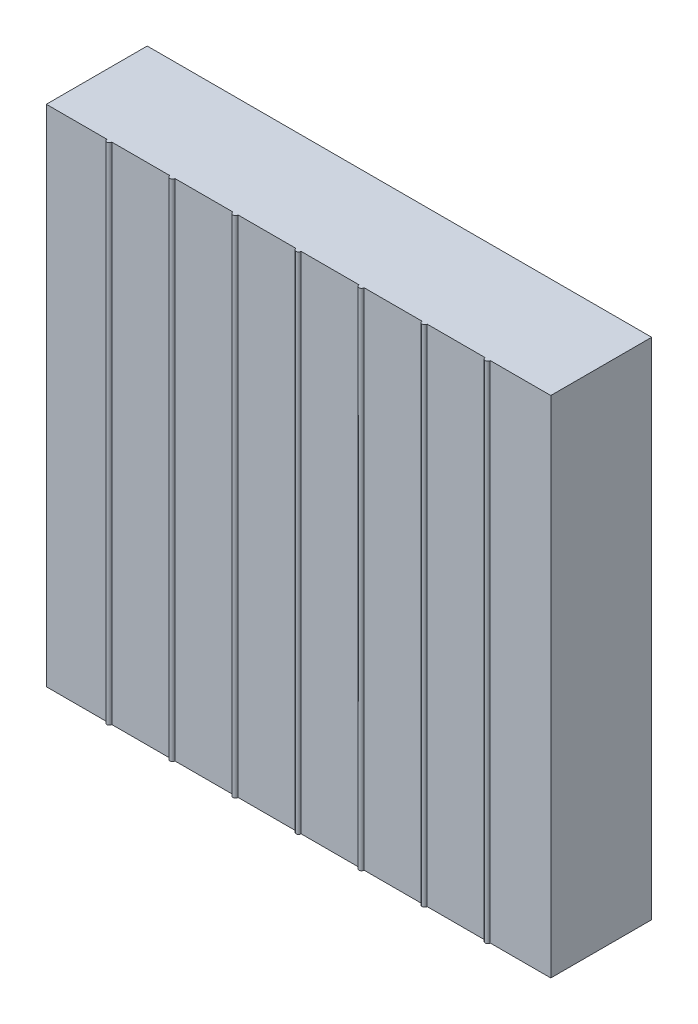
from build123d import *

# Parameters (mm, degrees)
ESQUISSE1_W          = 20
ESQUISSE1_H          = 20
BASE_EXTRUSION_DEPTH = 4
BOSS_EXTRU_1_DEPTH   = 20


with BuildPart() as part:
    # Esquisse1 → Base-Extrusion (new body)
    with BuildSketch(Plane.XY):
        Rectangle(ESQUISSE1_W, ESQUISSE1_H)
    extrude(amount=BASE_EXTRUSION_DEPTH)

    # Esquisse3 → Boss.-Extru.1 (add)
    with BuildSketch(Plane(origin=(0, 10, 0), x_dir=(-1, 0, 0), z_dir=(0, 1, 0))):
        with BuildLine():
            Line((-0.1, 4), (0.1, 4))
            ThreePointArc((0.1, 4), (0, 4.1), (-0.1, 4))
        make_face()
        with BuildLine():
            Line((2.4, 4), (2.6, 4))
            ThreePointArc((2.6, 4), (2.5, 4.1), (2.4, 4))
        make_face()
        with BuildLine():
            Line((4.9, 4), (5.1, 4))
            ThreePointArc((5.1, 4), (5, 4.1), (4.9, 4))
        make_face()
        with BuildLine():
            Line((7.4, 4), (7.6, 4))
            ThreePointArc((7.6, 4), (7.5, 4.1), (7.4, 4))
        make_face()
        with BuildLine():
            Line((-2.6, 4), (-2.4, 4))
            ThreePointArc((-2.4, 4), (-2.5, 4.1), (-2.6, 4))
        make_face()
        with BuildLine():
            Line((-5.1, 4), (-4.9, 4))
            ThreePointArc((-4.9, 4), (-5, 4.1), (-5.1, 4))
        make_face()
        with BuildLine():
            Line((-7.6, 4), (-7.4, 4))
            ThreePointArc((-7.4, 4), (-7.5, 4.1), (-7.6, 4))
        make_face()
    extrude(amount=-BOSS_EXTRU_1_DEPTH)


solid = part.part
